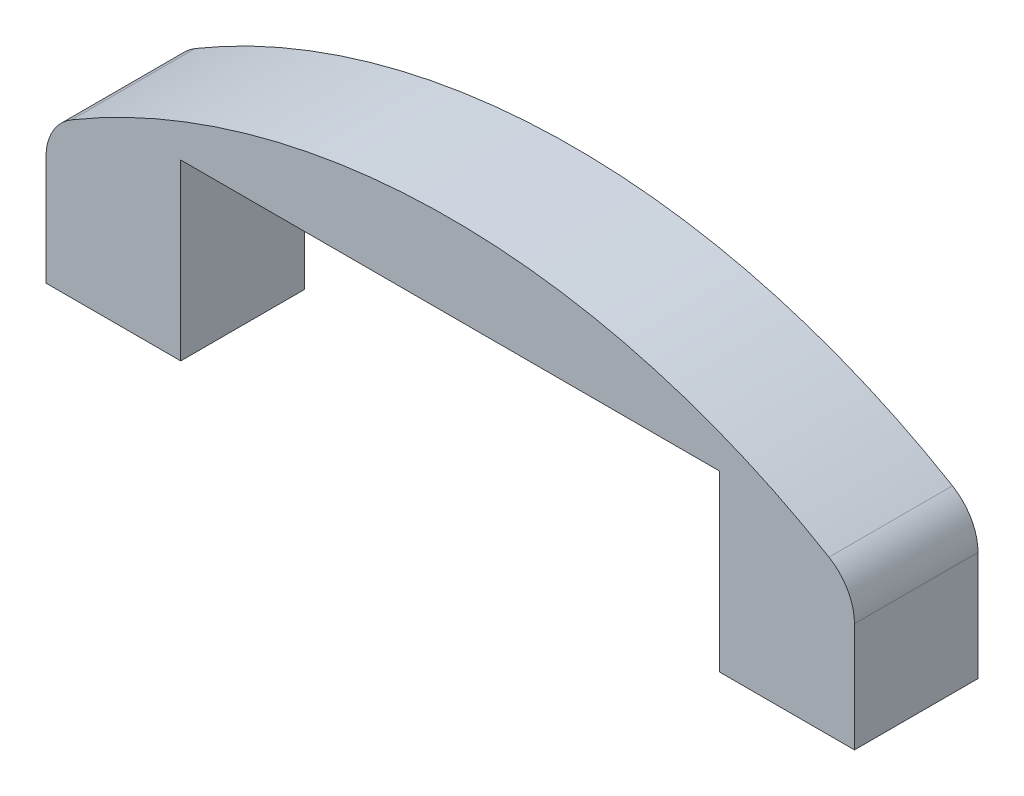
ISO-10303-21;
HEADER;
FILE_DESCRIPTION(('STEP AP214'),'2;1');
FILE_NAME('part.step','',(''),(''),'','','');
FILE_SCHEMA(('AUTOMOTIVE_DESIGN { 1 0 10303 214 1 1 1 1 }'));
ENDSEC;
DATA;
#1=APPLICATION_CONTEXT('core data for automotive mechanical design processes');
#2=APPLICATION_PROTOCOL_DEFINITION('international standard','automotive_design',2000,#1);
#3=PRODUCT_CONTEXT('',#1,'mechanical');
#4=PRODUCT('Part','Part','',(#3));
#5=PRODUCT_RELATED_PRODUCT_CATEGORY('part','',(#4));
#6=PRODUCT_DEFINITION_FORMATION('','',#4);
#7=PRODUCT_DEFINITION_CONTEXT('part definition',#1,'design');
#8=PRODUCT_DEFINITION('design','',#6,#7);
#9=PRODUCT_DEFINITION_SHAPE('','',#8);
#10=(LENGTH_UNIT() NAMED_UNIT(*) SI_UNIT(.MILLI.,.METRE.));
#11=(NAMED_UNIT(*) PLANE_ANGLE_UNIT() SI_UNIT($,.RADIAN.));
#12=(NAMED_UNIT(*) SI_UNIT($,.STERADIAN.) SOLID_ANGLE_UNIT());
#13=UNCERTAINTY_MEASURE_WITH_UNIT(LENGTH_MEASURE(1.E-05),#10,'distance_accuracy_value','');
#14=(GEOMETRIC_REPRESENTATION_CONTEXT(3) GLOBAL_UNCERTAINTY_ASSIGNED_CONTEXT((#13)) GLOBAL_UNIT_ASSIGNED_CONTEXT((#10,
#11,#12)) REPRESENTATION_CONTEXT('',''));
#15=CARTESIAN_POINT('',(0.,0.,0.));
#16=DIRECTION('',(0.,0.,1.));
#17=DIRECTION('',(1.,0.,0.));
#18=AXIS2_PLACEMENT_3D('',#15,#16,#17);
#19=CARTESIAN_POINT('',(-12.,0.,-11.));
#20=DIRECTION('',(0.,-1.,0.));
#21=DIRECTION('',(1.,0.,0.));
#22=AXIS2_PLACEMENT_3D('',#19,#20,#21);
#23=PLANE('',#22);
#24=CARTESIAN_POINT('',(119.999999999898,0.,0.));
#25=DIRECTION('',(0.,-1.,0.));
#26=DIRECTION('',(1.,0.,0.));
#27=AXIS2_PLACEMENT_3D('',#24,#25,#26);
#28=CIRCLE('',#27,2.99999999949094);
#29=CARTESIAN_POINT('',(122.999999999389,0.,0.));
#30=VERTEX_POINT('',#29);
#31=EDGE_CURVE('E198',#30,#30,#28,.F.);
#32=ORIENTED_EDGE('',*,*,#31,.T.);
#33=EDGE_LOOP('',(#32));
#34=FACE_BOUND('',#33,.T.);
#35=DIRECTION('',(0.,0.,-1.));
#36=VECTOR('',#35,1.);
#37=CARTESIAN_POINT('',(108.,0.,11.));
#38=LINE('',#37,#36);
#39=CARTESIAN_POINT('',(108.,0.,11.));
#40=VERTEX_POINT('',#39);
#41=CARTESIAN_POINT('',(108.,0.,-11.));
#42=VERTEX_POINT('',#41);
#43=EDGE_CURVE('E176',#40,#42,#38,.T.);
#44=ORIENTED_EDGE('',*,*,#43,.T.);
#45=DIRECTION('',(1.,0.,0.));
#46=VECTOR('',#45,1.);
#47=CARTESIAN_POINT('',(-12.,0.,-11.));
#48=LINE('',#47,#46);
#49=CARTESIAN_POINT('',(132.,0.,-11.));
#50=VERTEX_POINT('',#49);
#51=EDGE_CURVE('E235',#42,#50,#48,.T.);
#52=ORIENTED_EDGE('',*,*,#51,.T.);
#53=DIRECTION('',(0.,0.,1.));
#54=VECTOR('',#53,1.);
#55=CARTESIAN_POINT('',(132.,0.,-11.));
#56=LINE('',#55,#54);
#57=CARTESIAN_POINT('',(132.,0.,11.));
#58=VERTEX_POINT('',#57);
#59=EDGE_CURVE('E195',#50,#58,#56,.T.);
#60=ORIENTED_EDGE('',*,*,#59,.T.);
#61=DIRECTION('',(1.,0.,0.));
#62=VECTOR('',#61,1.);
#63=CARTESIAN_POINT('',(-12.,0.,11.));
#64=LINE('',#63,#62);
#65=EDGE_CURVE('E187',#40,#58,#64,.T.);
#66=ORIENTED_EDGE('',*,*,#65,.F.);
#67=EDGE_LOOP('',(#44,#52,#60,#66));
#68=FACE_BOUND('',#67,.T.);
#69=ADVANCED_FACE('F34',(#34,#68),#23,.T.);
#70=CARTESIAN_POINT('',(60.,-86.,-11.));
#71=DIRECTION('',(0.,0.,1.));
#72=DIRECTION('',(1.,0.,0.));
#73=AXIS2_PLACEMENT_3D('',#70,#71,#72);
#74=CYLINDRICAL_SURFACE('',#73,132.);
#75=CARTESIAN_POINT('',(60.,-86.,-11.));
#76=DIRECTION('',(0.,0.,1.));
#77=DIRECTION('',(1.,0.,0.));
#78=AXIS2_PLACEMENT_3D('',#75,#76,#77);
#79=CIRCLE('',#78,132.);
#80=CARTESIAN_POINT('',(127.452322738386,27.4644620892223,-11.));
#81=VERTEX_POINT('',#80);
#82=CARTESIAN_POINT('',(-7.45232273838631,27.4644620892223,-11.));
#83=VERTEX_POINT('',#82);
#84=EDGE_CURVE('E190',#81,#83,#79,.T.);
#85=ORIENTED_EDGE('',*,*,#84,.T.);
#86=DIRECTION('',(0.,0.,1.));
#87=VECTOR('',#86,1.);
#88=CARTESIAN_POINT('',(-7.4523227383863,27.4644620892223,-11.));
#89=LINE('',#88,#87);
#90=CARTESIAN_POINT('',(-7.45232273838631,27.4644620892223,11.));
#91=VERTEX_POINT('',#90);
#92=EDGE_CURVE('E212',#83,#91,#89,.T.);
#93=ORIENTED_EDGE('',*,*,#92,.T.);
#94=CARTESIAN_POINT('',(60.,-86.,11.));
#95=DIRECTION('',(0.,0.,1.));
#96=DIRECTION('',(1.,0.,0.));
#97=AXIS2_PLACEMENT_3D('',#94,#95,#96);
#98=CIRCLE('',#97,132.);
#99=CARTESIAN_POINT('',(127.452322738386,27.4644620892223,11.));
#100=VERTEX_POINT('',#99);
#101=EDGE_CURVE('E229',#100,#91,#98,.T.);
#102=ORIENTED_EDGE('',*,*,#101,.F.);
#103=DIRECTION('',(0.,0.,1.));
#104=VECTOR('',#103,1.);
#105=CARTESIAN_POINT('',(127.452322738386,27.4644620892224,-11.));
#106=LINE('',#105,#104);
#107=EDGE_CURVE('E210',#100,#81,#106,.F.);
#108=ORIENTED_EDGE('',*,*,#107,.T.);
#109=EDGE_LOOP('',(#85,#93,#102,#108));
#110=FACE_BOUND('',#109,.T.);
#111=ADVANCED_FACE('F136',(#110),#74,.T.);
#112=CARTESIAN_POINT('',(132.,0.,-11.));
#113=DIRECTION('',(1.,0.,0.));
#114=DIRECTION('',(0.,0.,-1.));
#115=AXIS2_PLACEMENT_3D('',#112,#113,#114);
#116=PLANE('',#115);
#117=DIRECTION('',(0.,1.,0.));
#118=VECTOR('',#117,1.);
#119=CARTESIAN_POINT('',(132.,0.,-11.));
#120=LINE('',#119,#118);
#121=CARTESIAN_POINT('',(132.,19.4703749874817,-11.));
#122=VERTEX_POINT('',#121);
#123=EDGE_CURVE('E201',#50,#122,#120,.T.);
#124=ORIENTED_EDGE('',*,*,#123,.T.);
#125=DIRECTION('',(0.,0.,1.));
#126=VECTOR('',#125,1.);
#127=CARTESIAN_POINT('',(132.,19.4703749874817,-11.));
#128=LINE('',#127,#126);
#129=CARTESIAN_POINT('',(132.,19.4703749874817,11.));
#130=VERTEX_POINT('',#129);
#131=EDGE_CURVE('E11',#122,#130,#128,.T.);
#132=ORIENTED_EDGE('',*,*,#131,.T.);
#133=DIRECTION('',(0.,1.,0.));
#134=VECTOR('',#133,1.);
#135=CARTESIAN_POINT('',(132.,0.,11.));
#136=LINE('',#135,#134);
#137=EDGE_CURVE('E186',#58,#130,#136,.T.);
#138=ORIENTED_EDGE('',*,*,#137,.F.);
#139=ORIENTED_EDGE('',*,*,#59,.F.);
#140=EDGE_LOOP('',(#124,#132,#138,#139));
#141=FACE_BOUND('',#140,.T.);
#142=ADVANCED_FACE('F143',(#141),#116,.T.);
#143=CARTESIAN_POINT('',(-2.0022897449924E-10,0.,0.));
#144=DIRECTION('',(0.,-1.,0.));
#145=DIRECTION('',(1.,0.,0.));
#146=AXIS2_PLACEMENT_3D('',#143,#144,#145);
#147=CIRCLE('',#146,2.99999999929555);
#148=CARTESIAN_POINT('',(2.99999999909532,0.,0.));
#149=VERTEX_POINT('',#148);
#150=EDGE_CURVE('E162',#149,#149,#147,.F.);
#151=ORIENTED_EDGE('',*,*,#150,.T.);
#152=EDGE_LOOP('',(#151));
#153=FACE_BOUND('',#152,.T.);
#154=DIRECTION('',(0.,0.,-1.));
#155=VECTOR('',#154,1.);
#156=CARTESIAN_POINT('',(12.,0.,11.));
#157=LINE('',#156,#155);
#158=CARTESIAN_POINT('',(12.,0.,11.));
#159=VERTEX_POINT('',#158);
#160=CARTESIAN_POINT('',(12.,0.,-11.));
#161=VERTEX_POINT('',#160);
#162=EDGE_CURVE('E166',#159,#161,#157,.T.);
#163=ORIENTED_EDGE('',*,*,#162,.F.);
#164=CARTESIAN_POINT('',(-12.,0.,11.));
#165=VERTEX_POINT('',#164);
#166=EDGE_CURVE('E169',#165,#159,#64,.T.);
#167=ORIENTED_EDGE('',*,*,#166,.F.);
#168=DIRECTION('',(0.,0.,1.));
#169=VECTOR('',#168,1.);
#170=CARTESIAN_POINT('',(-12.,0.,-11.));
#171=LINE('',#170,#169);
#172=CARTESIAN_POINT('',(-12.,0.,-11.));
#173=VERTEX_POINT('',#172);
#174=EDGE_CURVE('E199',#173,#165,#171,.T.);
#175=ORIENTED_EDGE('',*,*,#174,.F.);
#176=EDGE_CURVE('E171',#173,#161,#48,.T.);
#177=ORIENTED_EDGE('',*,*,#176,.T.);
#178=EDGE_LOOP('',(#163,#167,#175,#177));
#179=FACE_BOUND('',#178,.T.);
#180=ADVANCED_FACE('F139',(#153,#179),#23,.T.);
#181=CARTESIAN_POINT('',(-12.,24.6345334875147,-11.));
#182=DIRECTION('',(-1.,0.,0.));
#183=DIRECTION('',(0.,0.,1.));
#184=AXIS2_PLACEMENT_3D('',#181,#182,#183);
#185=PLANE('',#184);
#186=DIRECTION('',(0.,-1.,0.));
#187=VECTOR('',#186,1.);
#188=CARTESIAN_POINT('',(-12.,24.6345334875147,11.));
#189=LINE('',#188,#187);
#190=CARTESIAN_POINT('',(-12.,19.4703749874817,11.));
#191=VERTEX_POINT('',#190);
#192=EDGE_CURVE('E184',#191,#165,#189,.T.);
#193=ORIENTED_EDGE('',*,*,#192,.F.);
#194=DIRECTION('',(0.,0.,1.));
#195=VECTOR('',#194,1.);
#196=CARTESIAN_POINT('',(-12.,19.4703749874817,-11.));
#197=LINE('',#196,#195);
#198=CARTESIAN_POINT('',(-12.,19.4703749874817,-11.));
#199=VERTEX_POINT('',#198);
#200=EDGE_CURVE('E57',#191,#199,#197,.F.);
#201=ORIENTED_EDGE('',*,*,#200,.T.);
#202=DIRECTION('',(0.,-1.,0.));
#203=VECTOR('',#202,1.);
#204=CARTESIAN_POINT('',(-12.,24.6345334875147,-11.));
#205=LINE('',#204,#203);
#206=EDGE_CURVE('E222',#199,#173,#205,.T.);
#207=ORIENTED_EDGE('',*,*,#206,.T.);
#208=ORIENTED_EDGE('',*,*,#174,.T.);
#209=EDGE_LOOP('',(#193,#201,#207,#208));
#210=FACE_BOUND('',#209,.T.);
#211=ADVANCED_FACE('F151',(#210),#185,.T.);
#212=CARTESIAN_POINT('',(60.,-86.,-11.));
#213=DIRECTION('',(0.,0.,1.));
#214=DIRECTION('',(1.,0.,0.));
#215=AXIS2_PLACEMENT_3D('',#212,#213,#214);
#216=PLANE('',#215);
#217=ORIENTED_EDGE('',*,*,#206,.F.);
#218=CARTESIAN_POINT('',(-2.69999999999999,19.4703749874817,-11.));
#219=DIRECTION('',(0.,0.,1.));
#220=DIRECTION('',(1.,0.,0.));
#221=AXIS2_PLACEMENT_3D('',#218,#219,#220);
#222=CIRCLE('',#221,9.3);
#223=EDGE_CURVE('E42',#199,#83,#222,.F.);
#224=ORIENTED_EDGE('',*,*,#223,.T.);
#225=ORIENTED_EDGE('',*,*,#84,.F.);
#226=CARTESIAN_POINT('',(122.7,19.4703749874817,-11.));
#227=DIRECTION('',(0.,0.,1.));
#228=DIRECTION('',(1.,0.,0.));
#229=AXIS2_PLACEMENT_3D('',#226,#227,#228);
#230=CIRCLE('',#229,9.3);
#231=EDGE_CURVE('E49',#81,#122,#230,.F.);
#232=ORIENTED_EDGE('',*,*,#231,.T.);
#233=ORIENTED_EDGE('',*,*,#123,.F.);
#234=ORIENTED_EDGE('',*,*,#51,.F.);
#235=DIRECTION('',(0.,-1.,0.));
#236=VECTOR('',#235,1.);
#237=CARTESIAN_POINT('',(108.,31.,-11.));
#238=LINE('',#237,#236);
#239=CARTESIAN_POINT('',(108.,31.,-11.));
#240=VERTEX_POINT('',#239);
#241=EDGE_CURVE('E247',#240,#42,#238,.T.);
#242=ORIENTED_EDGE('',*,*,#241,.F.);
#243=DIRECTION('',(1.,0.,0.));
#244=VECTOR('',#243,1.);
#245=CARTESIAN_POINT('',(12.,31.,-11.));
#246=LINE('',#245,#244);
#247=CARTESIAN_POINT('',(12.,31.,-11.));
#248=VERTEX_POINT('',#247);
#249=EDGE_CURVE('E241',#248,#240,#246,.T.);
#250=ORIENTED_EDGE('',*,*,#249,.F.);
#251=DIRECTION('',(0.,1.,0.));
#252=VECTOR('',#251,1.);
#253=CARTESIAN_POINT('',(12.,0.,-11.));
#254=LINE('',#253,#252);
#255=EDGE_CURVE('E245',#161,#248,#254,.T.);
#256=ORIENTED_EDGE('',*,*,#255,.F.);
#257=ORIENTED_EDGE('',*,*,#176,.F.);
#258=EDGE_LOOP('',(#217,#224,#225,#232,#233,#234,#242,#250,#256,#257));
#259=FACE_BOUND('',#258,.T.);
#260=ADVANCED_FACE('F157',(#259),#216,.F.);
#261=CARTESIAN_POINT('',(60.,-86.,11.));
#262=DIRECTION('',(0.,0.,1.));
#263=DIRECTION('',(1.,0.,0.));
#264=AXIS2_PLACEMENT_3D('',#261,#262,#263);
#265=PLANE('',#264);
#266=ORIENTED_EDGE('',*,*,#101,.T.);
#267=CARTESIAN_POINT('',(-2.69999999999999,19.4703749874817,11.));
#268=DIRECTION('',(0.,0.,1.));
#269=DIRECTION('',(1.,0.,0.));
#270=AXIS2_PLACEMENT_3D('',#267,#268,#269);
#271=CIRCLE('',#270,9.3);
#272=EDGE_CURVE('E217',#91,#191,#271,.T.);
#273=ORIENTED_EDGE('',*,*,#272,.T.);
#274=ORIENTED_EDGE('',*,*,#192,.T.);
#275=ORIENTED_EDGE('',*,*,#166,.T.);
#276=DIRECTION('',(0.,1.,0.));
#277=VECTOR('',#276,1.);
#278=CARTESIAN_POINT('',(12.,0.,11.));
#279=LINE('',#278,#277);
#280=CARTESIAN_POINT('',(12.,31.,11.));
#281=VERTEX_POINT('',#280);
#282=EDGE_CURVE('E183',#159,#281,#279,.T.);
#283=ORIENTED_EDGE('',*,*,#282,.T.);
#284=DIRECTION('',(1.,0.,0.));
#285=VECTOR('',#284,1.);
#286=CARTESIAN_POINT('',(12.,31.,11.));
#287=LINE('',#286,#285);
#288=CARTESIAN_POINT('',(108.,31.,11.));
#289=VERTEX_POINT('',#288);
#290=EDGE_CURVE('E238',#281,#289,#287,.T.);
#291=ORIENTED_EDGE('',*,*,#290,.T.);
#292=DIRECTION('',(0.,-1.,0.));
#293=VECTOR('',#292,1.);
#294=CARTESIAN_POINT('',(108.,31.,11.));
#295=LINE('',#294,#293);
#296=EDGE_CURVE('E244',#289,#40,#295,.T.);
#297=ORIENTED_EDGE('',*,*,#296,.T.);
#298=ORIENTED_EDGE('',*,*,#65,.T.);
#299=ORIENTED_EDGE('',*,*,#137,.T.);
#300=CARTESIAN_POINT('',(122.7,19.4703749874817,11.));
#301=DIRECTION('',(0.,0.,1.));
#302=DIRECTION('',(1.,0.,0.));
#303=AXIS2_PLACEMENT_3D('',#300,#301,#302);
#304=CIRCLE('',#303,9.3);
#305=EDGE_CURVE('E215',#130,#100,#304,.T.);
#306=ORIENTED_EDGE('',*,*,#305,.T.);
#307=EDGE_LOOP('',(#266,#273,#274,#275,#283,#291,#297,#298,#299,#306));
#308=FACE_BOUND('',#307,.T.);
#309=ADVANCED_FACE('F181',(#308),#265,.T.);
#310=CARTESIAN_POINT('',(108.,31.,11.));
#311=DIRECTION('',(1.,0.,0.));
#312=DIRECTION('',(0.,0.,-1.));
#313=AXIS2_PLACEMENT_3D('',#310,#311,#312);
#314=PLANE('',#313);
#315=ORIENTED_EDGE('',*,*,#241,.T.);
#316=ORIENTED_EDGE('',*,*,#43,.F.);
#317=ORIENTED_EDGE('',*,*,#296,.F.);
#318=DIRECTION('',(0.,0.,-1.));
#319=VECTOR('',#318,1.);
#320=CARTESIAN_POINT('',(108.,31.,11.));
#321=LINE('',#320,#319);
#322=EDGE_CURVE('E230',#289,#240,#321,.T.);
#323=ORIENTED_EDGE('',*,*,#322,.T.);
#324=EDGE_LOOP('',(#315,#316,#317,#323));
#325=FACE_BOUND('',#324,.T.);
#326=ADVANCED_FACE('F413',(#325),#314,.F.);
#327=CARTESIAN_POINT('',(12.,31.,11.));
#328=DIRECTION('',(0.,1.,0.));
#329=DIRECTION('',(-1.,0.,0.));
#330=AXIS2_PLACEMENT_3D('',#327,#328,#329);
#331=PLANE('',#330);
#332=ORIENTED_EDGE('',*,*,#249,.T.);
#333=ORIENTED_EDGE('',*,*,#322,.F.);
#334=ORIENTED_EDGE('',*,*,#290,.F.);
#335=DIRECTION('',(0.,0.,-1.));
#336=VECTOR('',#335,1.);
#337=CARTESIAN_POINT('',(12.,31.,11.));
#338=LINE('',#337,#336);
#339=EDGE_CURVE('E175',#281,#248,#338,.T.);
#340=ORIENTED_EDGE('',*,*,#339,.T.);
#341=EDGE_LOOP('',(#332,#333,#334,#340));
#342=FACE_BOUND('',#341,.T.);
#343=ADVANCED_FACE('F405',(#342),#331,.F.);
#344=CARTESIAN_POINT('',(12.,0.,11.));
#345=DIRECTION('',(-1.,0.,0.));
#346=DIRECTION('',(0.,0.,1.));
#347=AXIS2_PLACEMENT_3D('',#344,#345,#346);
#348=PLANE('',#347);
#349=ORIENTED_EDGE('',*,*,#255,.T.);
#350=ORIENTED_EDGE('',*,*,#339,.F.);
#351=ORIENTED_EDGE('',*,*,#282,.F.);
#352=ORIENTED_EDGE('',*,*,#162,.T.);
#353=EDGE_LOOP('',(#349,#350,#351,#352));
#354=FACE_BOUND('',#353,.T.);
#355=ADVANCED_FACE('F397',(#354),#348,.F.);
#356=CARTESIAN_POINT('',(-2.0022897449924E-10,-7.9999114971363E-10,0.));
#357=DIRECTION('',(0.,1.,0.));
#358=DIRECTION('',(0.,0.,1.));
#359=AXIS2_PLACEMENT_3D('',#356,#357,#358);
#360=CYLINDRICAL_SURFACE('',#359,2.45849999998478);
#361=CARTESIAN_POINT('',(-2.0022897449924E-10,0.541499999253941,0.));
#362=DIRECTION('',(0.,-1.,0.));
#363=DIRECTION('',(0.,0.,-1.));
#364=AXIS2_PLACEMENT_3D('',#361,#362,#363);
#365=CIRCLE('',#364,2.45849999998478);
#366=CARTESIAN_POINT('',(-2.0022897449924E-10,0.541499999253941,-2.45849999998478));
#367=VERTEX_POINT('',#366);
#368=EDGE_CURVE('E207',#367,#367,#365,.T.);
#369=ORIENTED_EDGE('',*,*,#368,.T.);
#370=EDGE_LOOP('',(#369));
#371=FACE_BOUND('',#370,.T.);
#372=CARTESIAN_POINT('',(-2.0022897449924E-10,12.,0.));
#373=DIRECTION('',(0.,1.,0.));
#374=DIRECTION('',(0.,0.,1.));
#375=AXIS2_PLACEMENT_3D('',#372,#373,#374);
#376=CIRCLE('',#375,2.45849999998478);
#377=CARTESIAN_POINT('',(-2.0022897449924E-10,12.,2.45849999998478));
#378=VERTEX_POINT('',#377);
#379=EDGE_CURVE('E262',#378,#378,#376,.T.);
#380=ORIENTED_EDGE('',*,*,#379,.T.);
#381=EDGE_LOOP('',(#380));
#382=FACE_BOUND('',#381,.T.);
#383=ADVANCED_FACE('F388',(#371,#382),#360,.F.);
#384=CARTESIAN_POINT('',(-2.0022897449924E-10,18.2194156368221,0.));
#385=DIRECTION('',(0.,-1.,0.));
#386=DIRECTION('',(0.,0.,-1.));
#387=AXIS2_PLACEMENT_3D('',#384,#385,#386);
#388=CONICAL_SURFACE('',#387,0.,1.0471975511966);
#389=CARTESIAN_POINT('',(-2.0022897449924E-10,16.8000000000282,0.));
#390=DIRECTION('',(0.,1.,0.));
#391=DIRECTION('',(0.,0.,1.));
#392=AXIS2_PLACEMENT_3D('',#389,#390,#391);
#393=CIRCLE('',#392,2.45849999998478);
#394=CARTESIAN_POINT('',(-2.0022897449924E-10,16.8000000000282,2.45849999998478));
#395=VERTEX_POINT('',#394);
#396=EDGE_CURVE('E249',#395,#395,#393,.T.);
#397=ORIENTED_EDGE('',*,*,#396,.F.);
#398=EDGE_LOOP('',(#397));
#399=FACE_BOUND('',#398,.T.);
#400=CARTESIAN_POINT('',(-2.00228920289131E-10,18.2194156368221,0.));
#401=VERTEX_POINT('',#400);
#402=VERTEX_LOOP('',#401);
#403=FACE_BOUND('',#402,.T.);
#404=ADVANCED_FACE('F379',(#399,#403),#388,.F.);
#405=CARTESIAN_POINT('',(-2.0022897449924E-10,-7.9999114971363E-10,0.));
#406=DIRECTION('',(0.,1.,0.));
#407=DIRECTION('',(0.,0.,1.));
#408=AXIS2_PLACEMENT_3D('',#405,#406,#407);
#409=CYLINDRICAL_SURFACE('',#408,2.45849999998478);
#410=CARTESIAN_POINT('',(-2.0022897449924E-10,12.541500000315,0.));
#411=DIRECTION('',(0.,1.,0.));
#412=DIRECTION('',(0.,0.,1.));
#413=AXIS2_PLACEMENT_3D('',#410,#411,#412);
#414=CIRCLE('',#413,2.45849999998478);
#415=CARTESIAN_POINT('',(-2.0022897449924E-10,12.541500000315,2.45849999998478));
#416=VERTEX_POINT('',#415);
#417=EDGE_CURVE('E256',#416,#416,#414,.T.);
#418=ORIENTED_EDGE('',*,*,#417,.F.);
#419=EDGE_LOOP('',(#418));
#420=FACE_BOUND('',#419,.T.);
#421=ORIENTED_EDGE('',*,*,#396,.T.);
#422=EDGE_LOOP('',(#421));
#423=FACE_BOUND('',#422,.T.);
#424=ADVANCED_FACE('F370',(#420,#423),#409,.F.);
#425=CARTESIAN_POINT('',(-2.0022897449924E-10,12.541500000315,0.));
#426=DIRECTION('',(0.,-1.,0.));
#427=DIRECTION('',(0.,0.,-1.));
#428=AXIS2_PLACEMENT_3D('',#425,#426,#427);
#429=CONICAL_SURFACE('',#428,2.45849999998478,0.785398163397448);
#430=CARTESIAN_POINT('',(-2.0022897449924E-10,12.,0.));
#431=DIRECTION('',(0.,1.,0.));
#432=DIRECTION('',(0.,0.,1.));
#433=AXIS2_PLACEMENT_3D('',#430,#431,#432);
#434=CIRCLE('',#433,3.00000000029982);
#435=CARTESIAN_POINT('',(-2.0022897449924E-10,12.,3.00000000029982));
#436=VERTEX_POINT('',#435);
#437=EDGE_CURVE('E259',#436,#436,#434,.T.);
#438=ORIENTED_EDGE('',*,*,#437,.F.);
#439=EDGE_LOOP('',(#438));
#440=FACE_BOUND('',#439,.T.);
#441=ORIENTED_EDGE('',*,*,#417,.T.);
#442=EDGE_LOOP('',(#441));
#443=FACE_BOUND('',#442,.T.);
#444=ADVANCED_FACE('F361',(#440,#443),#429,.F.);
#445=CARTESIAN_POINT('',(3.00000000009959,12.,0.));
#446=DIRECTION('',(0.,-1.,0.));
#447=DIRECTION('',(0.,0.,-1.));
#448=AXIS2_PLACEMENT_3D('',#445,#446,#447);
#449=PLANE('',#448);
#450=ORIENTED_EDGE('',*,*,#379,.F.);
#451=EDGE_LOOP('',(#450));
#452=FACE_BOUND('',#451,.T.);
#453=ORIENTED_EDGE('',*,*,#437,.T.);
#454=EDGE_LOOP('',(#453));
#455=FACE_BOUND('',#454,.T.);
#456=ADVANCED_FACE('F131',(#452,#455),#449,.F.);
#457=CARTESIAN_POINT('',(119.999999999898,-8.00002593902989E-10,0.));
#458=DIRECTION('',(0.,1.,0.));
#459=DIRECTION('',(0.,0.,1.));
#460=AXIS2_PLACEMENT_3D('',#457,#458,#459);
#461=CYLINDRICAL_SURFACE('',#460,2.45850000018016);
#462=CARTESIAN_POINT('',(119.999999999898,0.541499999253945,0.));
#463=DIRECTION('',(0.,-1.,0.));
#464=DIRECTION('',(0.,0.,-1.));
#465=AXIS2_PLACEMENT_3D('',#462,#463,#464);
#466=CIRCLE('',#465,2.45850000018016);
#467=CARTESIAN_POINT('',(119.999999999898,0.541499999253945,-2.45850000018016));
#468=VERTEX_POINT('',#467);
#469=EDGE_CURVE('E203',#468,#468,#466,.T.);
#470=ORIENTED_EDGE('',*,*,#469,.T.);
#471=EDGE_LOOP('',(#470));
#472=FACE_BOUND('',#471,.T.);
#473=CARTESIAN_POINT('',(119.999999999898,12.,0.));
#474=DIRECTION('',(0.,1.,0.));
#475=DIRECTION('',(0.,0.,1.));
#476=AXIS2_PLACEMENT_3D('',#473,#474,#475);
#477=CIRCLE('',#476,2.45850000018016);
#478=CARTESIAN_POINT('',(119.999999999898,12.,2.45850000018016));
#479=VERTEX_POINT('',#478);
#480=EDGE_CURVE('E274',#479,#479,#477,.T.);
#481=ORIENTED_EDGE('',*,*,#480,.T.);
#482=EDGE_LOOP('',(#481));
#483=FACE_BOUND('',#482,.T.);
#484=ADVANCED_FACE('F121',(#472,#483),#461,.F.);
#485=CARTESIAN_POINT('',(119.999999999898,18.2194156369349,0.));
#486=DIRECTION('',(0.,-1.,0.));
#487=DIRECTION('',(0.,0.,-1.));
#488=AXIS2_PLACEMENT_3D('',#485,#486,#487);
#489=CONICAL_SURFACE('',#488,0.,1.0471975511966);
#490=CARTESIAN_POINT('',(119.999999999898,16.8000000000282,0.));
#491=DIRECTION('',(0.,1.,0.));
#492=DIRECTION('',(0.,0.,1.));
#493=AXIS2_PLACEMENT_3D('',#490,#491,#492);
#494=CIRCLE('',#493,2.45850000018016);
#495=CARTESIAN_POINT('',(119.999999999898,16.8000000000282,2.45850000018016));
#496=VERTEX_POINT('',#495);
#497=EDGE_CURVE('E265',#496,#496,#494,.T.);
#498=ORIENTED_EDGE('',*,*,#497,.F.);
#499=EDGE_LOOP('',(#498));
#500=FACE_BOUND('',#499,.T.);
#501=CARTESIAN_POINT('',(119.999999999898,18.2194156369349,0.));
#502=VERTEX_POINT('',#501);
#503=VERTEX_LOOP('',#502);
#504=FACE_BOUND('',#503,.T.);
#505=ADVANCED_FACE('F118',(#500,#504),#489,.F.);
#506=CARTESIAN_POINT('',(119.999999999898,-8.00002593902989E-10,0.));
#507=DIRECTION('',(0.,1.,0.));
#508=DIRECTION('',(0.,0.,1.));
#509=AXIS2_PLACEMENT_3D('',#506,#507,#508);
#510=CYLINDRICAL_SURFACE('',#509,2.45850000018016);
#511=CARTESIAN_POINT('',(119.999999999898,12.5415000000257,0.));
#512=DIRECTION('',(0.,1.,0.));
#513=DIRECTION('',(0.,0.,1.));
#514=AXIS2_PLACEMENT_3D('',#511,#512,#513);
#515=CIRCLE('',#514,2.45850000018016);
#516=CARTESIAN_POINT('',(119.999999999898,12.5415000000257,2.45850000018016));
#517=VERTEX_POINT('',#516);
#518=EDGE_CURVE('E268',#517,#517,#515,.T.);
#519=ORIENTED_EDGE('',*,*,#518,.F.);
#520=EDGE_LOOP('',(#519));
#521=FACE_BOUND('',#520,.T.);
#522=ORIENTED_EDGE('',*,*,#497,.T.);
#523=EDGE_LOOP('',(#522));
#524=FACE_BOUND('',#523,.T.);
#525=ADVANCED_FACE('F120',(#521,#524),#510,.F.);
#526=CARTESIAN_POINT('',(119.999999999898,12.5415000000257,0.));
#527=DIRECTION('',(0.,-1.,0.));
#528=DIRECTION('',(0.,0.,-1.));
#529=AXIS2_PLACEMENT_3D('',#526,#527,#528);
#530=CONICAL_SURFACE('',#529,2.45850000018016,0.785398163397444);
#531=CARTESIAN_POINT('',(119.999999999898,12.,0.));
#532=DIRECTION('',(0.,1.,0.));
#533=DIRECTION('',(0.,0.,1.));
#534=AXIS2_PLACEMENT_3D('',#531,#532,#533);
#535=CIRCLE('',#534,3.00000000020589);
#536=CARTESIAN_POINT('',(119.999999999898,12.,3.00000000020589));
#537=VERTEX_POINT('',#536);
#538=EDGE_CURVE('E271',#537,#537,#535,.T.);
#539=ORIENTED_EDGE('',*,*,#538,.F.);
#540=EDGE_LOOP('',(#539));
#541=FACE_BOUND('',#540,.T.);
#542=ORIENTED_EDGE('',*,*,#518,.T.);
#543=EDGE_LOOP('',(#542));
#544=FACE_BOUND('',#543,.T.);
#545=ADVANCED_FACE('F128',(#541,#544),#530,.F.);
#546=CARTESIAN_POINT('',(123.000000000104,12.,0.));
#547=DIRECTION('',(0.,-1.,0.));
#548=DIRECTION('',(0.,0.,-1.));
#549=AXIS2_PLACEMENT_3D('',#546,#547,#548);
#550=PLANE('',#549);
#551=ORIENTED_EDGE('',*,*,#480,.F.);
#552=EDGE_LOOP('',(#551));
#553=FACE_BOUND('',#552,.T.);
#554=ORIENTED_EDGE('',*,*,#538,.T.);
#555=EDGE_LOOP('',(#554));
#556=FACE_BOUND('',#555,.T.);
#557=ADVANCED_FACE('F279',(#553,#556),#550,.F.);
#558=CARTESIAN_POINT('',(119.999999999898,0.,0.));
#559=DIRECTION('',(0.,-1.,0.));
#560=DIRECTION('',(0.,0.,-1.));
#561=AXIS2_PLACEMENT_3D('',#558,#559,#560);
#562=CONICAL_SURFACE('',#561,2.99999999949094,0.785398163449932);
#563=ORIENTED_EDGE('',*,*,#469,.F.);
#564=EDGE_LOOP('',(#563));
#565=FACE_BOUND('',#564,.T.);
#566=ORIENTED_EDGE('',*,*,#31,.F.);
#567=EDGE_LOOP('',(#566));
#568=FACE_BOUND('',#567,.T.);
#569=ADVANCED_FACE('F282',(#565,#568),#562,.F.);
#570=CARTESIAN_POINT('',(-2.0022897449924E-10,0.,0.));
#571=DIRECTION('',(0.,-1.,0.));
#572=DIRECTION('',(0.,0.,-1.));
#573=AXIS2_PLACEMENT_3D('',#570,#571,#572);
#574=CONICAL_SURFACE('',#573,2.99999999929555,0.785398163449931);
#575=ORIENTED_EDGE('',*,*,#368,.F.);
#576=EDGE_LOOP('',(#575));
#577=FACE_BOUND('',#576,.T.);
#578=ORIENTED_EDGE('',*,*,#150,.F.);
#579=EDGE_LOOP('',(#578));
#580=FACE_BOUND('',#579,.T.);
#581=ADVANCED_FACE('F305',(#577,#580),#574,.F.);
#582=CARTESIAN_POINT('',(-2.69999999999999,19.4703749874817,-11.));
#583=DIRECTION('',(0.,0.,1.));
#584=DIRECTION('',(1.,0.,0.));
#585=AXIS2_PLACEMENT_3D('',#582,#583,#584);
#586=CYLINDRICAL_SURFACE('',#585,9.3);
#587=ORIENTED_EDGE('',*,*,#223,.F.);
#588=ORIENTED_EDGE('',*,*,#200,.F.);
#589=ORIENTED_EDGE('',*,*,#272,.F.);
#590=ORIENTED_EDGE('',*,*,#92,.F.);
#591=EDGE_LOOP('',(#587,#588,#589,#590));
#592=FACE_BOUND('',#591,.T.);
#593=ADVANCED_FACE('F228',(#592),#586,.T.);
#594=CARTESIAN_POINT('',(122.7,19.4703749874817,-11.));
#595=DIRECTION('',(0.,0.,1.));
#596=DIRECTION('',(1.,0.,0.));
#597=AXIS2_PLACEMENT_3D('',#594,#595,#596);
#598=CYLINDRICAL_SURFACE('',#597,9.3);
#599=ORIENTED_EDGE('',*,*,#231,.F.);
#600=ORIENTED_EDGE('',*,*,#107,.F.);
#601=ORIENTED_EDGE('',*,*,#305,.F.);
#602=ORIENTED_EDGE('',*,*,#131,.F.);
#603=EDGE_LOOP('',(#599,#600,#601,#602));
#604=FACE_BOUND('',#603,.T.);
#605=ADVANCED_FACE('F36',(#604),#598,.T.);
#606=CLOSED_SHELL('',(#69,#111,#142,#180,#211,#260,#309,#326,#343,#355,#383,#404,#424,#444,#456,
#484,#505,#525,#545,#557,#569,#581,#593,#605));
#607=MANIFOLD_SOLID_BREP('B2',#606);
#608=ADVANCED_BREP_SHAPE_REPRESENTATION('',(#18,#607),#14);
#609=SHAPE_DEFINITION_REPRESENTATION(#9,#608);
ENDSEC;
END-ISO-10303-21;
